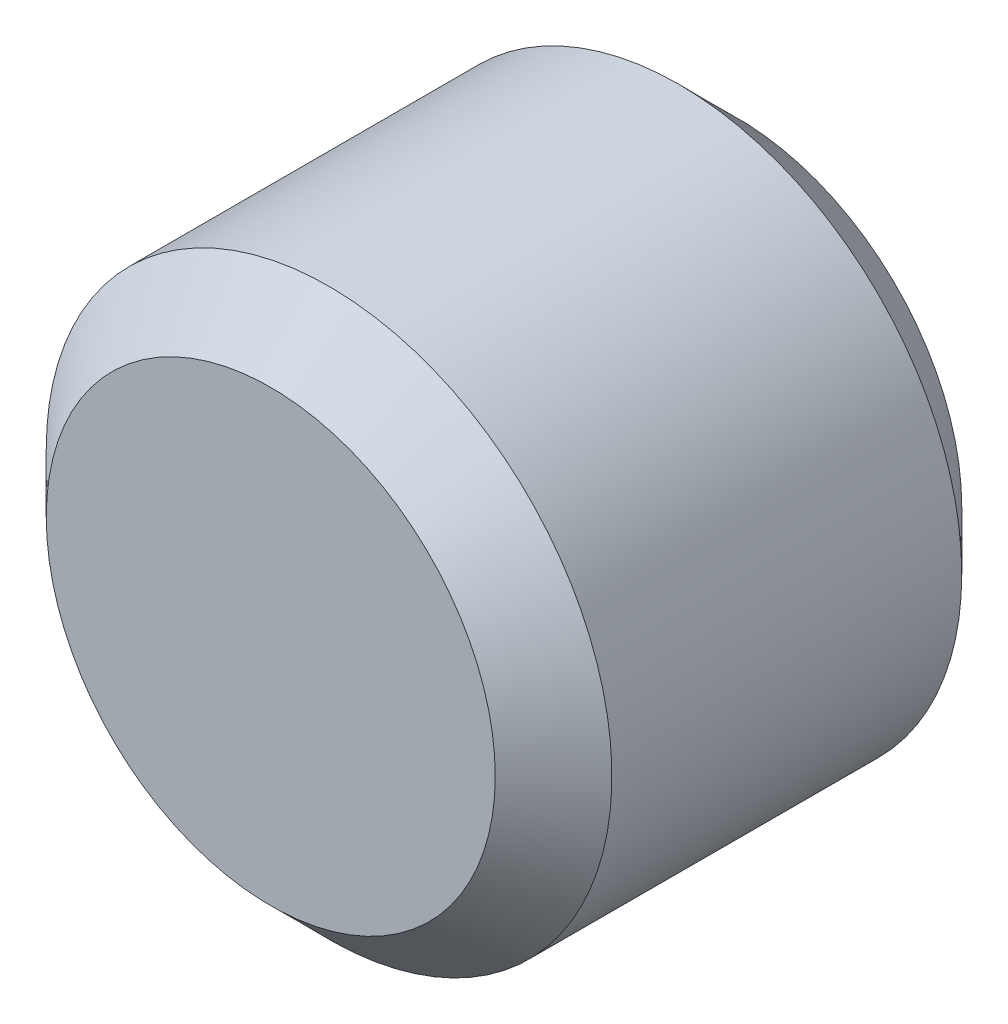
from build123d import *

# Parameters (mm, degrees)
ESQUISSE1_R             = 4.85
BASE_EXTRUSION_DEPTH    = 8
CHANFREIN1_SIZE         = 1
ENL_V_MAT_EXTRU_1_DEPTH = 5


with BuildPart() as part:
    # Esquisse1 → Base-Extrusion (new body)
    with BuildSketch(Plane.XY):
        with Locations(Location((0, 0, 0), (0, 0, 180))):
            Circle(ESQUISSE1_R)
    extrude(amount=BASE_EXTRUSION_DEPTH)

    # Chanfrein1
    chanfrein1_edges = [part.edges().sort_by_distance(p)[0] for p in [
        (4.85, 0, 0),
        (4.85, 0, 8),
    ]]
    chamfer(chanfrein1_edges, length=CHANFREIN1_SIZE)

    # Esquisse2 → Enl_v. mat.-Extru.1 (cut)
    with BuildSketch(Plane(origin=(0, 0, 0), x_dir=(-1, 0, 0), z_dir=(0, 0, -1))):
        Polygon((2.886751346, 0), (1.443375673, 2.5), (-1.443375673, 2.5), (-2.886751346, 0), (-1.443375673, -2.5), (1.443375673, -2.5), align=None)
    extrude(amount=-ENL_V_MAT_EXTRU_1_DEPTH, mode=Mode.SUBTRACT)


solid = part.part
